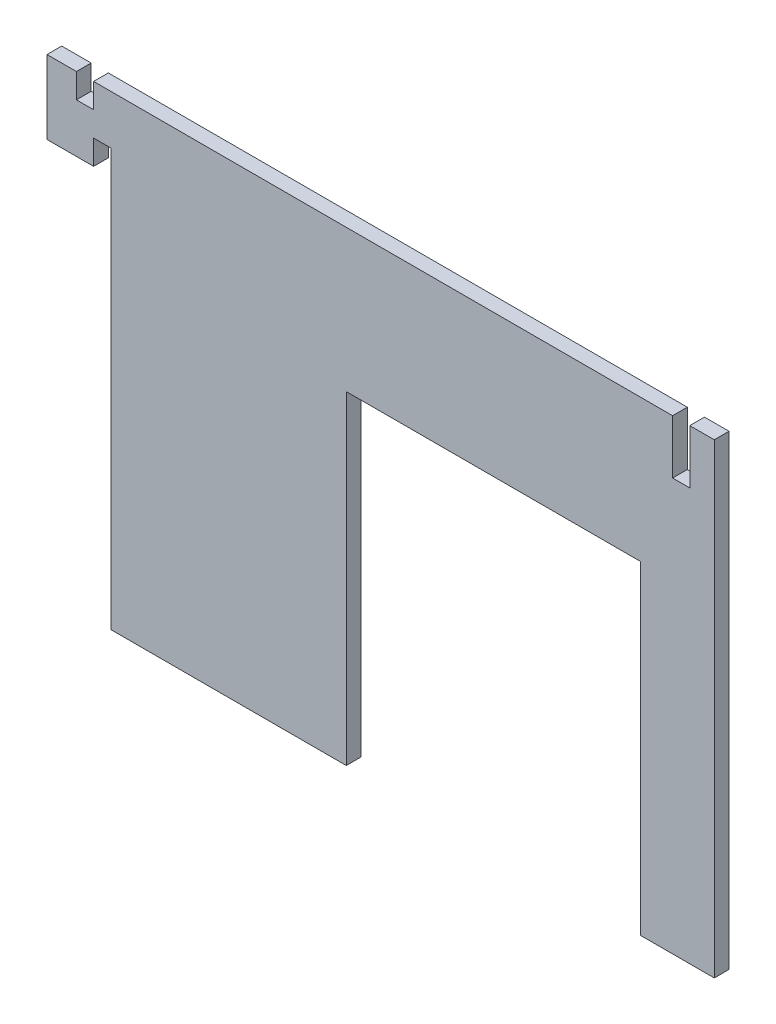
ISO-10303-21;
HEADER;
FILE_DESCRIPTION(('STEP AP214'),'2;1');
FILE_NAME('part.step','',(''),(''),'','','');
FILE_SCHEMA(('AUTOMOTIVE_DESIGN { 1 0 10303 214 1 1 1 1 }'));
ENDSEC;
DATA;
#1=APPLICATION_CONTEXT('core data for automotive mechanical design processes');
#2=APPLICATION_PROTOCOL_DEFINITION('international standard','automotive_design',2000,#1);
#3=PRODUCT_CONTEXT('',#1,'mechanical');
#4=PRODUCT('Part','Part','',(#3));
#5=PRODUCT_RELATED_PRODUCT_CATEGORY('part','',(#4));
#6=PRODUCT_DEFINITION_FORMATION('','',#4);
#7=PRODUCT_DEFINITION_CONTEXT('part definition',#1,'design');
#8=PRODUCT_DEFINITION('design','',#6,#7);
#9=PRODUCT_DEFINITION_SHAPE('','',#8);
#10=(LENGTH_UNIT() NAMED_UNIT(*) SI_UNIT(.MILLI.,.METRE.));
#11=(NAMED_UNIT(*) PLANE_ANGLE_UNIT() SI_UNIT($,.RADIAN.));
#12=(NAMED_UNIT(*) SI_UNIT($,.STERADIAN.) SOLID_ANGLE_UNIT());
#13=UNCERTAINTY_MEASURE_WITH_UNIT(LENGTH_MEASURE(1.E-05),#10,'distance_accuracy_value','');
#14=(GEOMETRIC_REPRESENTATION_CONTEXT(3) GLOBAL_UNCERTAINTY_ASSIGNED_CONTEXT((#13)) GLOBAL_UNIT_ASSIGNED_CONTEXT((#10,
#11,#12)) REPRESENTATION_CONTEXT('',''));
#15=CARTESIAN_POINT('',(0.,0.,0.));
#16=DIRECTION('',(0.,0.,1.));
#17=DIRECTION('',(1.,0.,0.));
#18=AXIS2_PLACEMENT_3D('',#15,#16,#17);
#19=CARTESIAN_POINT('',(0.,95.,3.));
#20=DIRECTION('',(0.,-1.,0.));
#21=DIRECTION('',(0.,0.,-1.));
#22=AXIS2_PLACEMENT_3D('',#19,#20,#21);
#23=PLANE('',#22);
#24=DIRECTION('',(-1.,0.,0.));
#25=VECTOR('',#24,1.);
#26=CARTESIAN_POINT('',(0.,95.,3.));
#27=LINE('',#26,#25);
#28=CARTESIAN_POINT('',(127.5,95.,3.));
#29=VERTEX_POINT('',#28);
#30=CARTESIAN_POINT('',(9.5,95.,3.));
#31=VERTEX_POINT('',#30);
#32=EDGE_CURVE('E302',#29,#31,#27,.T.);
#33=ORIENTED_EDGE('',*,*,#32,.F.);
#34=DIRECTION('',(0.,0.,1.));
#35=VECTOR('',#34,1.);
#36=CARTESIAN_POINT('',(127.5,95.,0.));
#37=LINE('',#36,#35);
#38=CARTESIAN_POINT('',(127.5,95.,0.));
#39=VERTEX_POINT('',#38);
#40=EDGE_CURVE('E197',#39,#29,#37,.T.);
#41=ORIENTED_EDGE('',*,*,#40,.F.);
#42=DIRECTION('',(-1.,0.,0.));
#43=VECTOR('',#42,1.);
#44=CARTESIAN_POINT('',(0.,95.,0.));
#45=LINE('',#44,#43);
#46=CARTESIAN_POINT('',(9.5,95.,0.));
#47=VERTEX_POINT('',#46);
#48=EDGE_CURVE('E188',#39,#47,#45,.T.);
#49=ORIENTED_EDGE('',*,*,#48,.T.);
#50=DIRECTION('',(0.,0.,1.));
#51=VECTOR('',#50,1.);
#52=CARTESIAN_POINT('',(9.5,95.,0.));
#53=LINE('',#52,#51);
#54=EDGE_CURVE('E242',#47,#31,#53,.T.);
#55=ORIENTED_EDGE('',*,*,#54,.T.);
#56=EDGE_LOOP('',(#33,#41,#49,#55));
#57=FACE_BOUND('',#56,.T.);
#58=ADVANCED_FACE('F31',(#57),#23,.F.);
#59=CARTESIAN_POINT('',(6.,95.,3.));
#60=VERTEX_POINT('',#59);
#61=CARTESIAN_POINT('',(0.,95.,3.));
#62=VERTEX_POINT('',#61);
#63=EDGE_CURVE('E297',#60,#62,#27,.T.);
#64=ORIENTED_EDGE('',*,*,#63,.F.);
#65=DIRECTION('',(0.,0.,1.));
#66=VECTOR('',#65,1.);
#67=CARTESIAN_POINT('',(6.,95.,0.));
#68=LINE('',#67,#66);
#69=CARTESIAN_POINT('',(6.,95.,0.));
#70=VERTEX_POINT('',#69);
#71=EDGE_CURVE('E239',#70,#60,#68,.T.);
#72=ORIENTED_EDGE('',*,*,#71,.F.);
#73=CARTESIAN_POINT('',(0.,95.,0.));
#74=VERTEX_POINT('',#73);
#75=EDGE_CURVE('E311',#70,#74,#45,.T.);
#76=ORIENTED_EDGE('',*,*,#75,.T.);
#77=DIRECTION('',(0.,0.,-1.));
#78=VECTOR('',#77,1.);
#79=CARTESIAN_POINT('',(0.,95.,3.));
#80=LINE('',#79,#78);
#81=EDGE_CURVE('E301',#62,#74,#80,.T.);
#82=ORIENTED_EDGE('',*,*,#81,.F.);
#83=EDGE_LOOP('',(#64,#72,#76,#82));
#84=FACE_BOUND('',#83,.T.);
#85=ADVANCED_FACE('F381',(#84),#23,.F.);
#86=CARTESIAN_POINT('',(0.,0.,3.));
#87=DIRECTION('',(0.,1.,0.));
#88=DIRECTION('',(0.,0.,1.));
#89=AXIS2_PLACEMENT_3D('',#86,#87,#88);
#90=PLANE('',#89);
#91=DIRECTION('',(1.,0.,0.));
#92=VECTOR('',#91,1.);
#93=CARTESIAN_POINT('',(0.,0.,0.));
#94=LINE('',#93,#92);
#95=CARTESIAN_POINT('',(13.,0.,0.));
#96=VERTEX_POINT('',#95);
#97=CARTESIAN_POINT('',(61.,0.,0.));
#98=VERTEX_POINT('',#97);
#99=EDGE_CURVE('E306',#96,#98,#94,.T.);
#100=ORIENTED_EDGE('',*,*,#99,.T.);
#101=DIRECTION('',(0.,0.,1.));
#102=VECTOR('',#101,1.);
#103=CARTESIAN_POINT('',(61.,0.,0.));
#104=LINE('',#103,#102);
#105=CARTESIAN_POINT('',(61.,0.,3.));
#106=VERTEX_POINT('',#105);
#107=EDGE_CURVE('E258',#98,#106,#104,.T.);
#108=ORIENTED_EDGE('',*,*,#107,.T.);
#109=DIRECTION('',(1.,0.,0.));
#110=VECTOR('',#109,1.);
#111=CARTESIAN_POINT('',(0.,0.,3.));
#112=LINE('',#111,#110);
#113=CARTESIAN_POINT('',(13.,0.,3.));
#114=VERTEX_POINT('',#113);
#115=EDGE_CURVE('E292',#114,#106,#112,.T.);
#116=ORIENTED_EDGE('',*,*,#115,.F.);
#117=DIRECTION('',(0.,0.,1.));
#118=VECTOR('',#117,1.);
#119=CARTESIAN_POINT('',(13.,0.,0.));
#120=LINE('',#119,#118);
#121=EDGE_CURVE('E279',#96,#114,#120,.T.);
#122=ORIENTED_EDGE('',*,*,#121,.F.);
#123=EDGE_LOOP('',(#100,#108,#116,#122));
#124=FACE_BOUND('',#123,.T.);
#125=ADVANCED_FACE('F346',(#124),#90,.F.);
#126=CARTESIAN_POINT('',(0.,0.,3.));
#127=DIRECTION('',(1.,0.,0.));
#128=DIRECTION('',(0.,0.,-1.));
#129=AXIS2_PLACEMENT_3D('',#126,#127,#128);
#130=PLANE('',#129);
#131=DIRECTION('',(0.,-1.,0.));
#132=VECTOR('',#131,1.);
#133=CARTESIAN_POINT('',(0.,0.,0.));
#134=LINE('',#133,#132);
#135=CARTESIAN_POINT('',(0.,80.,0.));
#136=VERTEX_POINT('',#135);
#137=EDGE_CURVE('E285',#74,#136,#134,.T.);
#138=ORIENTED_EDGE('',*,*,#137,.T.);
#139=DIRECTION('',(0.,0.,1.));
#140=VECTOR('',#139,1.);
#141=CARTESIAN_POINT('',(0.,80.,0.));
#142=LINE('',#141,#140);
#143=CARTESIAN_POINT('',(0.,80.,3.));
#144=VERTEX_POINT('',#143);
#145=EDGE_CURVE('E282',#136,#144,#142,.T.);
#146=ORIENTED_EDGE('',*,*,#145,.T.);
#147=DIRECTION('',(0.,-1.,0.));
#148=VECTOR('',#147,1.);
#149=CARTESIAN_POINT('',(0.,0.,3.));
#150=LINE('',#149,#148);
#151=EDGE_CURVE('E287',#62,#144,#150,.T.);
#152=ORIENTED_EDGE('',*,*,#151,.F.);
#153=ORIENTED_EDGE('',*,*,#81,.T.);
#154=EDGE_LOOP('',(#138,#146,#152,#153));
#155=FACE_BOUND('',#154,.T.);
#156=ADVANCED_FACE('F33',(#155),#130,.F.);
#157=CARTESIAN_POINT('',(121.,0.,3.));
#158=VERTEX_POINT('',#157);
#159=CARTESIAN_POINT('',(136.,0.,3.));
#160=VERTEX_POINT('',#159);
#161=EDGE_CURVE('E290',#158,#160,#112,.T.);
#162=ORIENTED_EDGE('',*,*,#161,.F.);
#163=DIRECTION('',(0.,0.,1.));
#164=VECTOR('',#163,1.);
#165=CARTESIAN_POINT('',(121.,0.,0.));
#166=LINE('',#165,#164);
#167=CARTESIAN_POINT('',(121.,0.,0.));
#168=VERTEX_POINT('',#167);
#169=EDGE_CURVE('E270',#168,#158,#166,.T.);
#170=ORIENTED_EDGE('',*,*,#169,.F.);
#171=CARTESIAN_POINT('',(136.,0.,0.));
#172=VERTEX_POINT('',#171);
#173=EDGE_CURVE('E305',#168,#172,#94,.T.);
#174=ORIENTED_EDGE('',*,*,#173,.T.);
#175=DIRECTION('',(0.,0.,-1.));
#176=VECTOR('',#175,1.);
#177=CARTESIAN_POINT('',(136.,0.,3.));
#178=LINE('',#177,#176);
#179=EDGE_CURVE('E11',#160,#172,#178,.T.);
#180=ORIENTED_EDGE('',*,*,#179,.F.);
#181=EDGE_LOOP('',(#162,#170,#174,#180));
#182=FACE_BOUND('',#181,.T.);
#183=ADVANCED_FACE('F329',(#182),#90,.F.);
#184=CARTESIAN_POINT('',(136.,0.,3.));
#185=DIRECTION('',(-1.,0.,0.));
#186=DIRECTION('',(0.,0.,1.));
#187=AXIS2_PLACEMENT_3D('',#184,#185,#186);
#188=PLANE('',#187);
#189=DIRECTION('',(0.,1.,0.));
#190=VECTOR('',#189,1.);
#191=CARTESIAN_POINT('',(136.,0.,0.));
#192=LINE('',#191,#190);
#193=CARTESIAN_POINT('',(136.,95.,0.));
#194=VERTEX_POINT('',#193);
#195=EDGE_CURVE('E309',#172,#194,#192,.T.);
#196=ORIENTED_EDGE('',*,*,#195,.T.);
#197=DIRECTION('',(0.,0.,-1.));
#198=VECTOR('',#197,1.);
#199=CARTESIAN_POINT('',(136.,95.,3.));
#200=LINE('',#199,#198);
#201=CARTESIAN_POINT('',(136.,95.,3.));
#202=VERTEX_POINT('',#201);
#203=EDGE_CURVE('E39',#202,#194,#200,.T.);
#204=ORIENTED_EDGE('',*,*,#203,.F.);
#205=DIRECTION('',(0.,1.,0.));
#206=VECTOR('',#205,1.);
#207=CARTESIAN_POINT('',(136.,0.,3.));
#208=LINE('',#207,#206);
#209=EDGE_CURVE('E295',#160,#202,#208,.T.);
#210=ORIENTED_EDGE('',*,*,#209,.F.);
#211=ORIENTED_EDGE('',*,*,#179,.T.);
#212=EDGE_LOOP('',(#196,#204,#210,#211));
#213=FACE_BOUND('',#212,.T.);
#214=ADVANCED_FACE('F325',(#213),#188,.F.);
#215=CARTESIAN_POINT('',(131.,95.,0.));
#216=VERTEX_POINT('',#215);
#217=EDGE_CURVE('E291',#194,#216,#45,.T.);
#218=ORIENTED_EDGE('',*,*,#217,.T.);
#219=DIRECTION('',(0.,0.,1.));
#220=VECTOR('',#219,1.);
#221=CARTESIAN_POINT('',(131.,95.,0.));
#222=LINE('',#221,#220);
#223=CARTESIAN_POINT('',(131.,95.,3.));
#224=VERTEX_POINT('',#223);
#225=EDGE_CURVE('E200',#216,#224,#222,.T.);
#226=ORIENTED_EDGE('',*,*,#225,.T.);
#227=EDGE_CURVE('E298',#202,#224,#27,.T.);
#228=ORIENTED_EDGE('',*,*,#227,.F.);
#229=ORIENTED_EDGE('',*,*,#203,.T.);
#230=EDGE_LOOP('',(#218,#226,#228,#229));
#231=FACE_BOUND('',#230,.T.);
#232=ADVANCED_FACE('F320',(#231),#23,.F.);
#233=CARTESIAN_POINT('',(0.,95.,3.));
#234=DIRECTION('',(0.,0.,-1.));
#235=DIRECTION('',(-1.,0.,0.));
#236=AXIS2_PLACEMENT_3D('',#233,#234,#235);
#237=PLANE('',#236);
#238=DIRECTION('',(1.,0.,0.));
#239=VECTOR('',#238,1.);
#240=CARTESIAN_POINT('',(127.5,84.,3.));
#241=LINE('',#240,#239);
#242=CARTESIAN_POINT('',(127.5,84.,3.));
#243=VERTEX_POINT('',#242);
#244=CARTESIAN_POINT('',(131.,84.,3.));
#245=VERTEX_POINT('',#244);
#246=EDGE_CURVE('E191',#243,#245,#241,.T.);
#247=ORIENTED_EDGE('',*,*,#246,.F.);
#248=DIRECTION('',(0.,-1.,0.));
#249=VECTOR('',#248,1.);
#250=CARTESIAN_POINT('',(127.5,95.,3.));
#251=LINE('',#250,#249);
#252=EDGE_CURVE('E175',#29,#243,#251,.T.);
#253=ORIENTED_EDGE('',*,*,#252,.F.);
#254=ORIENTED_EDGE('',*,*,#32,.T.);
#255=DIRECTION('',(0.,1.,0.));
#256=VECTOR('',#255,1.);
#257=CARTESIAN_POINT('',(9.5,95.,3.));
#258=LINE('',#257,#256);
#259=CARTESIAN_POINT('',(9.5,90.,3.));
#260=VERTEX_POINT('',#259);
#261=EDGE_CURVE('E227',#260,#31,#258,.T.);
#262=ORIENTED_EDGE('',*,*,#261,.F.);
#263=DIRECTION('',(1.,0.,0.));
#264=VECTOR('',#263,1.);
#265=CARTESIAN_POINT('',(6.,90.,3.));
#266=LINE('',#265,#264);
#267=CARTESIAN_POINT('',(6.,90.,3.));
#268=VERTEX_POINT('',#267);
#269=EDGE_CURVE('E234',#268,#260,#266,.T.);
#270=ORIENTED_EDGE('',*,*,#269,.F.);
#271=DIRECTION('',(0.,-1.,0.));
#272=VECTOR('',#271,1.);
#273=CARTESIAN_POINT('',(6.,95.,3.));
#274=LINE('',#273,#272);
#275=EDGE_CURVE('E218',#60,#268,#274,.T.);
#276=ORIENTED_EDGE('',*,*,#275,.F.);
#277=ORIENTED_EDGE('',*,*,#63,.T.);
#278=ORIENTED_EDGE('',*,*,#151,.T.);
#279=DIRECTION('',(-1.,0.,0.));
#280=VECTOR('',#279,1.);
#281=CARTESIAN_POINT('',(0.,80.,3.));
#282=LINE('',#281,#280);
#283=CARTESIAN_POINT('',(9.5,80.,3.));
#284=VERTEX_POINT('',#283);
#285=EDGE_CURVE('E277',#284,#144,#282,.T.);
#286=ORIENTED_EDGE('',*,*,#285,.F.);
#287=DIRECTION('',(0.,-1.,0.));
#288=VECTOR('',#287,1.);
#289=CARTESIAN_POINT('',(9.5,80.,3.));
#290=LINE('',#289,#288);
#291=CARTESIAN_POINT('',(9.5,85.,3.));
#292=VERTEX_POINT('',#291);
#293=EDGE_CURVE('E208',#292,#284,#290,.T.);
#294=ORIENTED_EDGE('',*,*,#293,.F.);
#295=DIRECTION('',(-1.,0.,0.));
#296=VECTOR('',#295,1.);
#297=CARTESIAN_POINT('',(13.,85.,3.));
#298=LINE('',#297,#296);
#299=CARTESIAN_POINT('',(13.,85.,3.));
#300=VERTEX_POINT('',#299);
#301=EDGE_CURVE('E199',#300,#292,#298,.T.);
#302=ORIENTED_EDGE('',*,*,#301,.F.);
#303=DIRECTION('',(0.,1.,0.));
#304=VECTOR('',#303,1.);
#305=CARTESIAN_POINT('',(13.,80.,3.));
#306=LINE('',#305,#304);
#307=EDGE_CURVE('E267',#114,#300,#306,.T.);
#308=ORIENTED_EDGE('',*,*,#307,.F.);
#309=ORIENTED_EDGE('',*,*,#115,.T.);
#310=DIRECTION('',(0.,-1.,0.));
#311=VECTOR('',#310,1.);
#312=CARTESIAN_POINT('',(61.,0.,3.));
#313=LINE('',#312,#311);
#314=CARTESIAN_POINT('',(61.,66.,3.));
#315=VERTEX_POINT('',#314);
#316=EDGE_CURVE('E241',#315,#106,#313,.T.);
#317=ORIENTED_EDGE('',*,*,#316,.F.);
#318=DIRECTION('',(-1.,0.,0.));
#319=VECTOR('',#318,1.);
#320=CARTESIAN_POINT('',(61.,66.,3.));
#321=LINE('',#320,#319);
#322=CARTESIAN_POINT('',(121.,66.,3.));
#323=VERTEX_POINT('',#322);
#324=EDGE_CURVE('E252',#323,#315,#321,.T.);
#325=ORIENTED_EDGE('',*,*,#324,.F.);
#326=DIRECTION('',(0.,1.,0.));
#327=VECTOR('',#326,1.);
#328=CARTESIAN_POINT('',(121.,0.,3.));
#329=LINE('',#328,#327);
#330=EDGE_CURVE('E260',#158,#323,#329,.T.);
#331=ORIENTED_EDGE('',*,*,#330,.F.);
#332=ORIENTED_EDGE('',*,*,#161,.T.);
#333=ORIENTED_EDGE('',*,*,#209,.T.);
#334=ORIENTED_EDGE('',*,*,#227,.T.);
#335=DIRECTION('',(0.,1.,0.));
#336=VECTOR('',#335,1.);
#337=CARTESIAN_POINT('',(131.,95.,3.));
#338=LINE('',#337,#336);
#339=EDGE_CURVE('E189',#245,#224,#338,.T.);
#340=ORIENTED_EDGE('',*,*,#339,.F.);
#341=EDGE_LOOP('',(#247,#253,#254,#262,#270,#276,#277,#278,#286,#294,#302,#308,#309,#317,#325,
#331,#332,#333,#334,#340));
#342=FACE_BOUND('',#341,.T.);
#343=ADVANCED_FACE('F337',(#342),#237,.F.);
#344=CARTESIAN_POINT('',(0.,95.,0.));
#345=DIRECTION('',(0.,0.,-1.));
#346=DIRECTION('',(-1.,0.,0.));
#347=AXIS2_PLACEMENT_3D('',#344,#345,#346);
#348=PLANE('',#347);
#349=DIRECTION('',(0.,-1.,0.));
#350=VECTOR('',#349,1.);
#351=CARTESIAN_POINT('',(127.5,95.,0.));
#352=LINE('',#351,#350);
#353=CARTESIAN_POINT('',(127.5,84.,0.));
#354=VERTEX_POINT('',#353);
#355=EDGE_CURVE('E172',#39,#354,#352,.T.);
#356=ORIENTED_EDGE('',*,*,#355,.T.);
#357=DIRECTION('',(1.,0.,0.));
#358=VECTOR('',#357,1.);
#359=CARTESIAN_POINT('',(127.5,84.,0.));
#360=LINE('',#359,#358);
#361=CARTESIAN_POINT('',(131.,84.,0.));
#362=VERTEX_POINT('',#361);
#363=EDGE_CURVE('E182',#354,#362,#360,.T.);
#364=ORIENTED_EDGE('',*,*,#363,.T.);
#365=DIRECTION('',(0.,1.,0.));
#366=VECTOR('',#365,1.);
#367=CARTESIAN_POINT('',(131.,95.,0.));
#368=LINE('',#367,#366);
#369=EDGE_CURVE('E46',#362,#216,#368,.T.);
#370=ORIENTED_EDGE('',*,*,#369,.T.);
#371=ORIENTED_EDGE('',*,*,#217,.F.);
#372=ORIENTED_EDGE('',*,*,#195,.F.);
#373=ORIENTED_EDGE('',*,*,#173,.F.);
#374=DIRECTION('',(0.,1.,0.));
#375=VECTOR('',#374,1.);
#376=CARTESIAN_POINT('',(121.,0.,0.));
#377=LINE('',#376,#375);
#378=CARTESIAN_POINT('',(121.,66.,0.));
#379=VERTEX_POINT('',#378);
#380=EDGE_CURVE('E251',#168,#379,#377,.T.);
#381=ORIENTED_EDGE('',*,*,#380,.T.);
#382=DIRECTION('',(-1.,0.,0.));
#383=VECTOR('',#382,1.);
#384=CARTESIAN_POINT('',(61.,66.,0.));
#385=LINE('',#384,#383);
#386=CARTESIAN_POINT('',(61.,66.,0.));
#387=VERTEX_POINT('',#386);
#388=EDGE_CURVE('E255',#379,#387,#385,.T.);
#389=ORIENTED_EDGE('',*,*,#388,.T.);
#390=DIRECTION('',(0.,-1.,0.));
#391=VECTOR('',#390,1.);
#392=CARTESIAN_POINT('',(61.,0.,0.));
#393=LINE('',#392,#391);
#394=EDGE_CURVE('E248',#387,#98,#393,.T.);
#395=ORIENTED_EDGE('',*,*,#394,.T.);
#396=ORIENTED_EDGE('',*,*,#99,.F.);
#397=DIRECTION('',(0.,1.,0.));
#398=VECTOR('',#397,1.);
#399=CARTESIAN_POINT('',(13.,80.,0.));
#400=LINE('',#399,#398);
#401=CARTESIAN_POINT('',(13.,85.,0.));
#402=VERTEX_POINT('',#401);
#403=EDGE_CURVE('E274',#96,#402,#400,.T.);
#404=ORIENTED_EDGE('',*,*,#403,.T.);
#405=DIRECTION('',(-1.,0.,0.));
#406=VECTOR('',#405,1.);
#407=CARTESIAN_POINT('',(13.,85.,0.));
#408=LINE('',#407,#406);
#409=CARTESIAN_POINT('',(9.5,85.,0.));
#410=VERTEX_POINT('',#409);
#411=EDGE_CURVE('E204',#402,#410,#408,.T.);
#412=ORIENTED_EDGE('',*,*,#411,.T.);
#413=DIRECTION('',(0.,-1.,0.));
#414=VECTOR('',#413,1.);
#415=CARTESIAN_POINT('',(9.5,80.,0.));
#416=LINE('',#415,#414);
#417=CARTESIAN_POINT('',(9.5,80.,0.));
#418=VERTEX_POINT('',#417);
#419=EDGE_CURVE('E207',#410,#418,#416,.T.);
#420=ORIENTED_EDGE('',*,*,#419,.T.);
#421=DIRECTION('',(-1.,0.,0.));
#422=VECTOR('',#421,1.);
#423=CARTESIAN_POINT('',(0.,80.,0.));
#424=LINE('',#423,#422);
#425=EDGE_CURVE('E276',#418,#136,#424,.T.);
#426=ORIENTED_EDGE('',*,*,#425,.T.);
#427=ORIENTED_EDGE('',*,*,#137,.F.);
#428=ORIENTED_EDGE('',*,*,#75,.F.);
#429=DIRECTION('',(0.,-1.,0.));
#430=VECTOR('',#429,1.);
#431=CARTESIAN_POINT('',(6.,95.,0.));
#432=LINE('',#431,#430);
#433=CARTESIAN_POINT('',(6.,90.,0.));
#434=VERTEX_POINT('',#433);
#435=EDGE_CURVE('E223',#70,#434,#432,.T.);
#436=ORIENTED_EDGE('',*,*,#435,.T.);
#437=DIRECTION('',(1.,0.,0.));
#438=VECTOR('',#437,1.);
#439=CARTESIAN_POINT('',(6.,90.,0.));
#440=LINE('',#439,#438);
#441=CARTESIAN_POINT('',(9.5,90.,0.));
#442=VERTEX_POINT('',#441);
#443=EDGE_CURVE('E226',#434,#442,#440,.T.);
#444=ORIENTED_EDGE('',*,*,#443,.T.);
#445=DIRECTION('',(0.,1.,0.));
#446=VECTOR('',#445,1.);
#447=CARTESIAN_POINT('',(9.5,95.,0.));
#448=LINE('',#447,#446);
#449=EDGE_CURVE('E54',#442,#47,#448,.T.);
#450=ORIENTED_EDGE('',*,*,#449,.T.);
#451=ORIENTED_EDGE('',*,*,#48,.F.);
#452=EDGE_LOOP('',(#356,#364,#370,#371,#372,#373,#381,#389,#395,#396,#404,#412,#420,#426,#427,
#428,#436,#444,#450,#451));
#453=FACE_BOUND('',#452,.T.);
#454=ADVANCED_FACE('F187',(#453),#348,.T.);
#455=CARTESIAN_POINT('',(0.,80.,0.));
#456=DIRECTION('',(0.,1.,0.));
#457=DIRECTION('',(0.,0.,1.));
#458=AXIS2_PLACEMENT_3D('',#455,#456,#457);
#459=PLANE('',#458);
#460=ORIENTED_EDGE('',*,*,#425,.F.);
#461=DIRECTION('',(0.,0.,1.));
#462=VECTOR('',#461,1.);
#463=CARTESIAN_POINT('',(9.5,80.,0.));
#464=LINE('',#463,#462);
#465=EDGE_CURVE('E215',#418,#284,#464,.T.);
#466=ORIENTED_EDGE('',*,*,#465,.T.);
#467=ORIENTED_EDGE('',*,*,#285,.T.);
#468=ORIENTED_EDGE('',*,*,#145,.F.);
#469=EDGE_LOOP('',(#460,#466,#467,#468));
#470=FACE_BOUND('',#469,.T.);
#471=ADVANCED_FACE('F364',(#470),#459,.F.);
#472=CARTESIAN_POINT('',(13.,80.,0.));
#473=DIRECTION('',(1.,0.,0.));
#474=DIRECTION('',(0.,1.,0.));
#475=AXIS2_PLACEMENT_3D('',#472,#473,#474);
#476=PLANE('',#475);
#477=ORIENTED_EDGE('',*,*,#307,.T.);
#478=DIRECTION('',(0.,0.,1.));
#479=VECTOR('',#478,1.);
#480=CARTESIAN_POINT('',(13.,85.,0.));
#481=LINE('',#480,#479);
#482=EDGE_CURVE('E211',#402,#300,#481,.T.);
#483=ORIENTED_EDGE('',*,*,#482,.F.);
#484=ORIENTED_EDGE('',*,*,#403,.F.);
#485=ORIENTED_EDGE('',*,*,#121,.T.);
#486=EDGE_LOOP('',(#477,#483,#484,#485));
#487=FACE_BOUND('',#486,.T.);
#488=ADVANCED_FACE('F350',(#487),#476,.F.);
#489=CARTESIAN_POINT('',(61.,0.,0.));
#490=DIRECTION('',(-1.,0.,0.));
#491=DIRECTION('',(0.,0.,1.));
#492=AXIS2_PLACEMENT_3D('',#489,#490,#491);
#493=PLANE('',#492);
#494=ORIENTED_EDGE('',*,*,#316,.T.);
#495=ORIENTED_EDGE('',*,*,#107,.F.);
#496=ORIENTED_EDGE('',*,*,#394,.F.);
#497=DIRECTION('',(0.,0.,1.));
#498=VECTOR('',#497,1.);
#499=CARTESIAN_POINT('',(61.,66.,0.));
#500=LINE('',#499,#498);
#501=EDGE_CURVE('E265',#387,#315,#500,.T.);
#502=ORIENTED_EDGE('',*,*,#501,.T.);
#503=EDGE_LOOP('',(#494,#495,#496,#502));
#504=FACE_BOUND('',#503,.T.);
#505=ADVANCED_FACE('F420',(#504),#493,.F.);
#506=CARTESIAN_POINT('',(61.,66.,0.));
#507=DIRECTION('',(0.,1.,0.));
#508=DIRECTION('',(0.,0.,1.));
#509=AXIS2_PLACEMENT_3D('',#506,#507,#508);
#510=PLANE('',#509);
#511=ORIENTED_EDGE('',*,*,#324,.T.);
#512=ORIENTED_EDGE('',*,*,#501,.F.);
#513=ORIENTED_EDGE('',*,*,#388,.F.);
#514=DIRECTION('',(0.,0.,1.));
#515=VECTOR('',#514,1.);
#516=CARTESIAN_POINT('',(121.,66.,0.));
#517=LINE('',#516,#515);
#518=EDGE_CURVE('E268',#379,#323,#517,.T.);
#519=ORIENTED_EDGE('',*,*,#518,.T.);
#520=EDGE_LOOP('',(#511,#512,#513,#519));
#521=FACE_BOUND('',#520,.T.);
#522=ADVANCED_FACE('F340',(#521),#510,.F.);
#523=CARTESIAN_POINT('',(121.,0.,0.));
#524=DIRECTION('',(1.,0.,0.));
#525=DIRECTION('',(0.,0.,-1.));
#526=AXIS2_PLACEMENT_3D('',#523,#524,#525);
#527=PLANE('',#526);
#528=ORIENTED_EDGE('',*,*,#330,.T.);
#529=ORIENTED_EDGE('',*,*,#518,.F.);
#530=ORIENTED_EDGE('',*,*,#380,.F.);
#531=ORIENTED_EDGE('',*,*,#169,.T.);
#532=EDGE_LOOP('',(#528,#529,#530,#531));
#533=FACE_BOUND('',#532,.T.);
#534=ADVANCED_FACE('F333',(#533),#527,.F.);
#535=CARTESIAN_POINT('',(6.,95.,0.));
#536=DIRECTION('',(-1.,0.,0.));
#537=DIRECTION('',(0.,0.,1.));
#538=AXIS2_PLACEMENT_3D('',#535,#536,#537);
#539=PLANE('',#538);
#540=ORIENTED_EDGE('',*,*,#275,.T.);
#541=DIRECTION('',(0.,0.,1.));
#542=VECTOR('',#541,1.);
#543=CARTESIAN_POINT('',(6.,90.,0.));
#544=LINE('',#543,#542);
#545=EDGE_CURVE('E231',#434,#268,#544,.T.);
#546=ORIENTED_EDGE('',*,*,#545,.F.);
#547=ORIENTED_EDGE('',*,*,#435,.F.);
#548=ORIENTED_EDGE('',*,*,#71,.T.);
#549=EDGE_LOOP('',(#540,#546,#547,#548));
#550=FACE_BOUND('',#549,.T.);
#551=ADVANCED_FACE('F440',(#550),#539,.F.);
#552=CARTESIAN_POINT('',(9.5,95.,0.));
#553=DIRECTION('',(1.,0.,0.));
#554=DIRECTION('',(0.,0.,-1.));
#555=AXIS2_PLACEMENT_3D('',#552,#553,#554);
#556=PLANE('',#555);
#557=ORIENTED_EDGE('',*,*,#261,.T.);
#558=ORIENTED_EDGE('',*,*,#54,.F.);
#559=ORIENTED_EDGE('',*,*,#449,.F.);
#560=DIRECTION('',(0.,0.,1.));
#561=VECTOR('',#560,1.);
#562=CARTESIAN_POINT('',(9.5,90.,0.));
#563=LINE('',#562,#561);
#564=EDGE_CURVE('E245',#442,#260,#563,.T.);
#565=ORIENTED_EDGE('',*,*,#564,.T.);
#566=EDGE_LOOP('',(#557,#558,#559,#565));
#567=FACE_BOUND('',#566,.T.);
#568=ADVANCED_FACE('F373',(#567),#556,.F.);
#569=CARTESIAN_POINT('',(6.,90.,0.));
#570=DIRECTION('',(0.,-1.,0.));
#571=DIRECTION('',(0.,0.,-1.));
#572=AXIS2_PLACEMENT_3D('',#569,#570,#571);
#573=PLANE('',#572);
#574=ORIENTED_EDGE('',*,*,#269,.T.);
#575=ORIENTED_EDGE('',*,*,#564,.F.);
#576=ORIENTED_EDGE('',*,*,#443,.F.);
#577=ORIENTED_EDGE('',*,*,#545,.T.);
#578=EDGE_LOOP('',(#574,#575,#576,#577));
#579=FACE_BOUND('',#578,.T.);
#580=ADVANCED_FACE('F377',(#579),#573,.F.);
#581=CARTESIAN_POINT('',(9.5,80.,0.));
#582=DIRECTION('',(-1.,0.,0.));
#583=DIRECTION('',(0.,0.,1.));
#584=AXIS2_PLACEMENT_3D('',#581,#582,#583);
#585=PLANE('',#584);
#586=ORIENTED_EDGE('',*,*,#293,.T.);
#587=ORIENTED_EDGE('',*,*,#465,.F.);
#588=ORIENTED_EDGE('',*,*,#419,.F.);
#589=DIRECTION('',(0.,0.,1.));
#590=VECTOR('',#589,1.);
#591=CARTESIAN_POINT('',(9.5,85.,0.));
#592=LINE('',#591,#590);
#593=EDGE_CURVE('E219',#410,#292,#592,.T.);
#594=ORIENTED_EDGE('',*,*,#593,.T.);
#595=EDGE_LOOP('',(#586,#587,#588,#594));
#596=FACE_BOUND('',#595,.T.);
#597=ADVANCED_FACE('F471',(#596),#585,.F.);
#598=CARTESIAN_POINT('',(13.,85.,0.));
#599=DIRECTION('',(0.,1.,0.));
#600=DIRECTION('',(0.,0.,1.));
#601=AXIS2_PLACEMENT_3D('',#598,#599,#600);
#602=PLANE('',#601);
#603=ORIENTED_EDGE('',*,*,#301,.T.);
#604=ORIENTED_EDGE('',*,*,#593,.F.);
#605=ORIENTED_EDGE('',*,*,#411,.F.);
#606=ORIENTED_EDGE('',*,*,#482,.T.);
#607=EDGE_LOOP('',(#603,#604,#605,#606));
#608=FACE_BOUND('',#607,.T.);
#609=ADVANCED_FACE('F356',(#608),#602,.F.);
#610=CARTESIAN_POINT('',(127.5,95.,0.));
#611=DIRECTION('',(-1.,0.,0.));
#612=DIRECTION('',(0.,0.,1.));
#613=AXIS2_PLACEMENT_3D('',#610,#611,#612);
#614=PLANE('',#613);
#615=ORIENTED_EDGE('',*,*,#252,.T.);
#616=DIRECTION('',(0.,0.,1.));
#617=VECTOR('',#616,1.);
#618=CARTESIAN_POINT('',(127.5,84.,0.));
#619=LINE('',#618,#617);
#620=EDGE_CURVE('E168',#354,#243,#619,.T.);
#621=ORIENTED_EDGE('',*,*,#620,.F.);
#622=ORIENTED_EDGE('',*,*,#355,.F.);
#623=ORIENTED_EDGE('',*,*,#40,.T.);
#624=EDGE_LOOP('',(#615,#621,#622,#623));
#625=FACE_BOUND('',#624,.T.);
#626=ADVANCED_FACE('F170',(#625),#614,.F.);
#627=CARTESIAN_POINT('',(131.,95.,0.));
#628=DIRECTION('',(1.,0.,0.));
#629=DIRECTION('',(0.,0.,-1.));
#630=AXIS2_PLACEMENT_3D('',#627,#628,#629);
#631=PLANE('',#630);
#632=ORIENTED_EDGE('',*,*,#339,.T.);
#633=ORIENTED_EDGE('',*,*,#225,.F.);
#634=ORIENTED_EDGE('',*,*,#369,.F.);
#635=DIRECTION('',(0.,0.,1.));
#636=VECTOR('',#635,1.);
#637=CARTESIAN_POINT('',(131.,84.,0.));
#638=LINE('',#637,#636);
#639=EDGE_CURVE('E179',#362,#245,#638,.T.);
#640=ORIENTED_EDGE('',*,*,#639,.T.);
#641=EDGE_LOOP('',(#632,#633,#634,#640));
#642=FACE_BOUND('',#641,.T.);
#643=ADVANCED_FACE('F534',(#642),#631,.F.);
#644=CARTESIAN_POINT('',(127.5,84.,0.));
#645=DIRECTION('',(0.,-1.,0.));
#646=DIRECTION('',(0.,0.,-1.));
#647=AXIS2_PLACEMENT_3D('',#644,#645,#646);
#648=PLANE('',#647);
#649=ORIENTED_EDGE('',*,*,#246,.T.);
#650=ORIENTED_EDGE('',*,*,#639,.F.);
#651=ORIENTED_EDGE('',*,*,#363,.F.);
#652=ORIENTED_EDGE('',*,*,#620,.T.);
#653=EDGE_LOOP('',(#649,#650,#651,#652));
#654=FACE_BOUND('',#653,.T.);
#655=ADVANCED_FACE('F183',(#654),#648,.F.);
#656=CLOSED_SHELL('',(#58,#85,#125,#156,#183,#214,#232,#343,#454,#471,#488,#505,#522,#534,#551,
#568,#580,#597,#609,#626,#643,#655));
#657=MANIFOLD_SOLID_BREP('B2',#656);
#658=ADVANCED_BREP_SHAPE_REPRESENTATION('',(#18,#657),#14);
#659=SHAPE_DEFINITION_REPRESENTATION(#9,#658);
ENDSEC;
END-ISO-10303-21;
